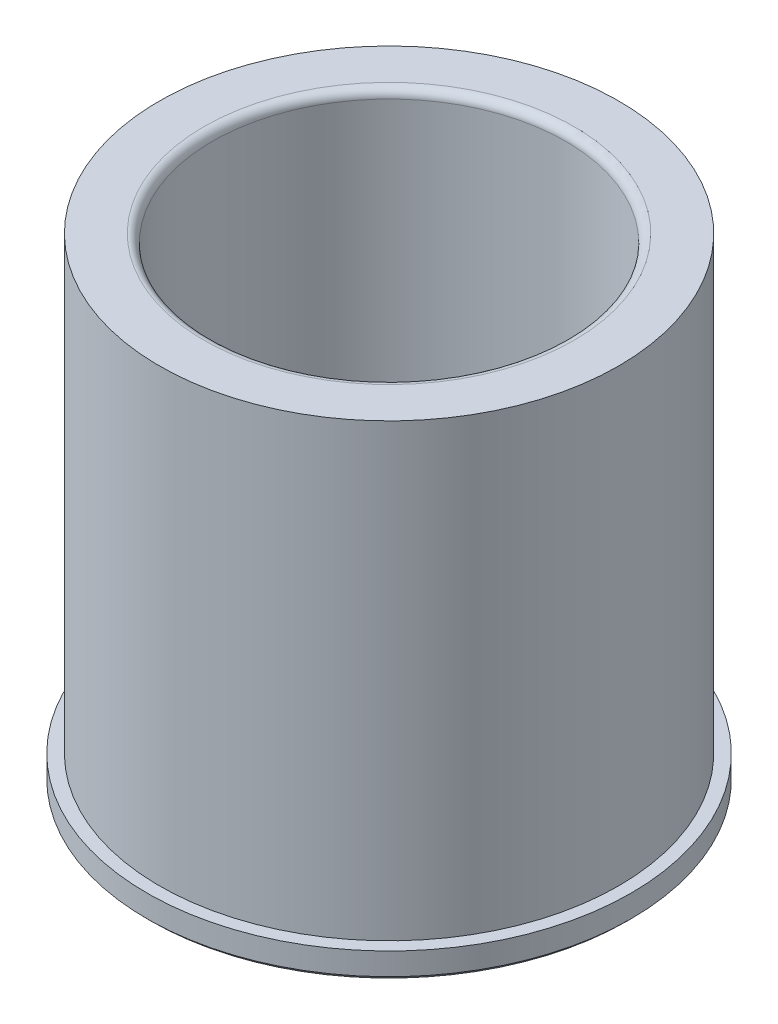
from build123d import *

# Parameters (mm, degrees)
FILLET1_R = 1.524


with BuildPart() as part:
    # Sketch1 → Revolve1 (revolve)
    with BuildSketch(Plane.XY, mode=Mode.PRIVATE) as revolve1_sk:
        Polygon((-42.7609, 0), (-43.5229, 0.762), (-43.5229, 4.7625), (-41.28135, 4.7625), (-41.28135, 85.725), (-31.75635, 85.725), (-31.75635, 0.762), (-32.51835, 0), align=None)
    revolve(revolve1_sk.sketch.rotate(Axis((0, -1000, 0), (0, 1, 0)), 180), axis=Axis((0, -1000, 0), (0, 1, 0)))

    # Fillet1
    fillet1_edges = [part.edges().sort_by_distance(p)[0] for p in [
        (-31.75635, 85.725, 0),
    ]]
    fillet(fillet1_edges, radius=FILLET1_R)


solid = part.part
